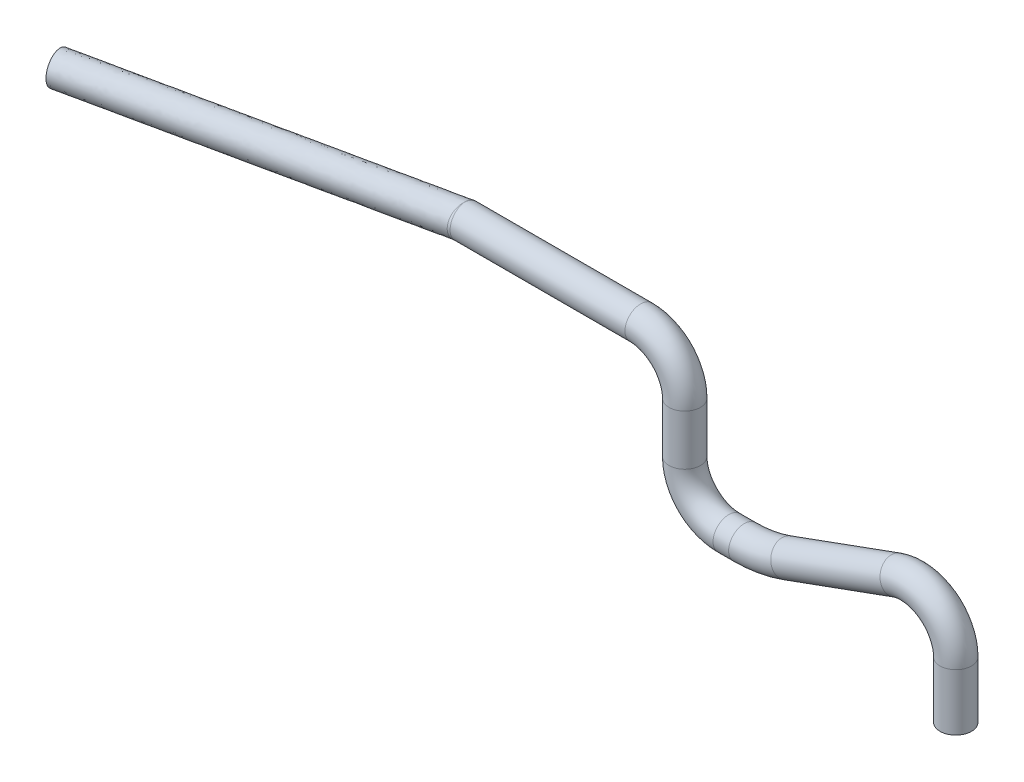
ISO-10303-21;
HEADER;
FILE_DESCRIPTION(('STEP AP214'),'2;1');
FILE_NAME('part.step','',(''),(''),'','','');
FILE_SCHEMA(('AUTOMOTIVE_DESIGN { 1 0 10303 214 1 1 1 1 }'));
ENDSEC;
DATA;
#1=APPLICATION_CONTEXT('core data for automotive mechanical design processes');
#2=APPLICATION_PROTOCOL_DEFINITION('international standard','automotive_design',2000,#1);
#3=PRODUCT_CONTEXT('',#1,'mechanical');
#4=PRODUCT('Part','Part','',(#3));
#5=PRODUCT_RELATED_PRODUCT_CATEGORY('part','',(#4));
#6=PRODUCT_DEFINITION_FORMATION('','',#4);
#7=PRODUCT_DEFINITION_CONTEXT('part definition',#1,'design');
#8=PRODUCT_DEFINITION('design','',#6,#7);
#9=PRODUCT_DEFINITION_SHAPE('','',#8);
#10=(LENGTH_UNIT() NAMED_UNIT(*) SI_UNIT(.MILLI.,.METRE.));
#11=(NAMED_UNIT(*) PLANE_ANGLE_UNIT() SI_UNIT($,.RADIAN.));
#12=(NAMED_UNIT(*) SI_UNIT($,.STERADIAN.) SOLID_ANGLE_UNIT());
#13=UNCERTAINTY_MEASURE_WITH_UNIT(LENGTH_MEASURE(1.E-05),#10,'distance_accuracy_value','');
#14=(GEOMETRIC_REPRESENTATION_CONTEXT(3) GLOBAL_UNCERTAINTY_ASSIGNED_CONTEXT((#13)) GLOBAL_UNIT_ASSIGNED_CONTEXT((#10,
#11,#12)) REPRESENTATION_CONTEXT('',''));
#15=CARTESIAN_POINT('',(0.,0.,0.));
#16=DIRECTION('',(0.,0.,1.));
#17=DIRECTION('',(1.,0.,0.));
#18=AXIS2_PLACEMENT_3D('',#15,#16,#17);
#19=CARTESIAN_POINT('',(43.0701638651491,-21.0523914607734,0.));
#20=DIRECTION('',(0.,-1.,0.));
#21=DIRECTION('',(1.,0.,0.));
#22=AXIS2_PLACEMENT_3D('',#19,#20,#21);
#23=CYLINDRICAL_SURFACE('',#22,2.5);
#24=CARTESIAN_POINT('',(43.0701638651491,-21.0523914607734,0.));
#25=DIRECTION('',(0.,-1.,0.));
#26=DIRECTION('',(0.,0.,-1.));
#27=AXIS2_PLACEMENT_3D('',#24,#25,#26);
#28=CIRCLE('',#27,2.5);
#29=CARTESIAN_POINT('',(45.5701638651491,-21.0523914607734,0.));
#30=VERTEX_POINT('',#29);
#31=EDGE_CURVE('E143',#30,#30,#28,.T.);
#32=ORIENTED_EDGE('',*,*,#31,.T.);
#33=EDGE_LOOP('',(#32));
#34=FACE_BOUND('',#33,.T.);
#35=CARTESIAN_POINT('',(43.0701638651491,-30.0553554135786,0.));
#36=DIRECTION('',(0.,-1.,0.));
#37=DIRECTION('',(0.,0.,-1.));
#38=AXIS2_PLACEMENT_3D('',#35,#36,#37);
#39=CIRCLE('',#38,2.5);
#40=CARTESIAN_POINT('',(43.0701638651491,-30.0553554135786,-2.5));
#41=VERTEX_POINT('',#40);
#42=EDGE_CURVE('E59',#41,#41,#39,.T.);
#43=ORIENTED_EDGE('',*,*,#42,.F.);
#44=EDGE_LOOP('',(#43));
#45=FACE_BOUND('',#44,.T.);
#46=ADVANCED_FACE('F28',(#34,#45),#23,.T.);
#47=CARTESIAN_POINT('',(36.0701638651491,-21.0523914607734,0.));
#48=DIRECTION('',(0.,0.,-1.));
#49=DIRECTION('',(-1.,0.,0.));
#50=AXIS2_PLACEMENT_3D('',#47,#48,#49);
#51=TOROIDAL_SURFACE('',#50,7.,2.5);
#52=CARTESIAN_POINT('',(33.6760228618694,-14.474543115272,0.));
#53=DIRECTION('',(0.939692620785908,0.34202014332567,0.));
#54=DIRECTION('',(0.,0.,-1.));
#55=AXIS2_PLACEMENT_3D('',#52,#53,#54);
#56=CIRCLE('',#55,2.5);
#57=CARTESIAN_POINT('',(32.8209725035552,-12.1253115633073,0.));
#58=VERTEX_POINT('',#57);
#59=EDGE_CURVE('E140',#58,#58,#56,.T.);
#60=CARTESIAN_POINT('',(36.0701638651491,-21.0523914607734,0.));
#61=DIRECTION('',(0.,0.,-1.));
#62=DIRECTION('',(-1.,0.,0.));
#63=AXIS2_PLACEMENT_3D('',#60,#61,#62);
#64=CIRCLE('',#63,9.5);
#65=EDGE_CURVE('',#58,#30,#64,.T.);
#66=ORIENTED_EDGE('',*,*,#59,.T.);
#67=ORIENTED_EDGE('',*,*,#31,.F.);
#68=ORIENTED_EDGE('',*,*,#65,.T.);
#69=ORIENTED_EDGE('',*,*,#65,.F.);
#70=EDGE_LOOP('',(#66,#68,#67,#69));
#71=FACE_BOUND('',#70,.T.);
#72=ADVANCED_FACE('F150',(#71),#51,.T.);
#73=CARTESIAN_POINT('',(16.3138632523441,-20.7938524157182,0.));
#74=DIRECTION('',(0.939692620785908,0.34202014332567,0.));
#75=DIRECTION('',(-0.34202014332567,0.939692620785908,0.));
#76=AXIS2_PLACEMENT_3D('',#73,#74,#75);
#77=CYLINDRICAL_SURFACE('',#76,2.5);
#78=CARTESIAN_POINT('',(16.3138632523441,-20.7938524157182,0.));
#79=DIRECTION('',(0.939692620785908,0.34202014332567,0.));
#80=DIRECTION('',(0.,0.,-1.));
#81=AXIS2_PLACEMENT_3D('',#78,#79,#80);
#82=CIRCLE('',#81,2.5);
#83=CARTESIAN_POINT('',(17.1689136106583,-23.1430839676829,0.));
#84=VERTEX_POINT('',#83);
#85=EDGE_CURVE('E137',#84,#84,#82,.T.);
#86=ORIENTED_EDGE('',*,*,#85,.T.);
#87=EDGE_LOOP('',(#86));
#88=FACE_BOUND('',#87,.T.);
#89=ORIENTED_EDGE('',*,*,#59,.F.);
#90=EDGE_LOOP('',(#89));
#91=FACE_BOUND('',#90,.T.);
#92=ADVANCED_FACE('F156',(#88,#91),#77,.T.);
#93=CARTESIAN_POINT('',(9.47346038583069,-2.,0.));
#94=DIRECTION('',(0.,0.,1.));
#95=DIRECTION('',(1.,0.,0.));
#96=AXIS2_PLACEMENT_3D('',#93,#94,#95);
#97=TOROIDAL_SURFACE('',#96,20.,2.5);
#98=CARTESIAN_POINT('',(9.47346038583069,-22.,0.));
#99=DIRECTION('',(1.,0.,0.));
#100=DIRECTION('',(0.,0.,-1.));
#101=AXIS2_PLACEMENT_3D('',#98,#99,#100);
#102=CIRCLE('',#101,2.5);
#103=CARTESIAN_POINT('',(9.47346038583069,-24.5,0.));
#104=VERTEX_POINT('',#103);
#105=EDGE_CURVE('E134',#104,#104,#102,.T.);
#106=CARTESIAN_POINT('',(9.47346038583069,-2.,0.));
#107=DIRECTION('',(0.,0.,1.));
#108=DIRECTION('',(1.,0.,0.));
#109=AXIS2_PLACEMENT_3D('',#106,#107,#108);
#110=CIRCLE('',#109,22.5);
#111=EDGE_CURVE('',#104,#84,#110,.T.);
#112=ORIENTED_EDGE('',*,*,#105,.T.);
#113=ORIENTED_EDGE('',*,*,#85,.F.);
#114=ORIENTED_EDGE('',*,*,#111,.T.);
#115=ORIENTED_EDGE('',*,*,#111,.F.);
#116=EDGE_LOOP('',(#112,#114,#113,#115));
#117=FACE_BOUND('',#116,.T.);
#118=ADVANCED_FACE('F163',(#117),#97,.T.);
#119=CARTESIAN_POINT('',(7.00000000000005,-22.,0.));
#120=DIRECTION('',(1.,0.,0.));
#121=DIRECTION('',(0.,1.,0.));
#122=AXIS2_PLACEMENT_3D('',#119,#120,#121);
#123=CYLINDRICAL_SURFACE('',#122,2.5);
#124=CARTESIAN_POINT('',(7.00000000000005,-22.,0.));
#125=DIRECTION('',(1.,0.,0.));
#126=DIRECTION('',(0.,0.,-1.));
#127=AXIS2_PLACEMENT_3D('',#124,#125,#126);
#128=CIRCLE('',#127,2.5);
#129=CARTESIAN_POINT('',(7.00000000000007,-24.5,0.));
#130=VERTEX_POINT('',#129);
#131=EDGE_CURVE('E131',#130,#130,#128,.T.);
#132=ORIENTED_EDGE('',*,*,#131,.T.);
#133=EDGE_LOOP('',(#132));
#134=FACE_BOUND('',#133,.T.);
#135=ORIENTED_EDGE('',*,*,#105,.F.);
#136=EDGE_LOOP('',(#135));
#137=FACE_BOUND('',#136,.T.);
#138=ADVANCED_FACE('F167',(#134,#137),#123,.T.);
#139=CARTESIAN_POINT('',(7.,-15.,0.));
#140=DIRECTION('',(0.,0.,1.));
#141=DIRECTION('',(1.,0.,0.));
#142=AXIS2_PLACEMENT_3D('',#139,#140,#141);
#143=TOROIDAL_SURFACE('',#142,7.,2.5);
#144=CARTESIAN_POINT('',(0.,-14.9999999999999,0.));
#145=DIRECTION('',(0.,-1.,0.));
#146=DIRECTION('',(0.,0.,-1.));
#147=AXIS2_PLACEMENT_3D('',#144,#145,#146);
#148=CIRCLE('',#147,2.5);
#149=CARTESIAN_POINT('',(-2.5,-14.9999999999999,0.));
#150=VERTEX_POINT('',#149);
#151=EDGE_CURVE('E128',#150,#150,#148,.T.);
#152=CARTESIAN_POINT('',(7.,-15.,0.));
#153=DIRECTION('',(0.,0.,1.));
#154=DIRECTION('',(1.,0.,0.));
#155=AXIS2_PLACEMENT_3D('',#152,#153,#154);
#156=CIRCLE('',#155,9.5);
#157=EDGE_CURVE('',#150,#130,#156,.T.);
#158=ORIENTED_EDGE('',*,*,#151,.T.);
#159=ORIENTED_EDGE('',*,*,#131,.F.);
#160=ORIENTED_EDGE('',*,*,#157,.T.);
#161=ORIENTED_EDGE('',*,*,#157,.F.);
#162=EDGE_LOOP('',(#158,#160,#159,#161));
#163=FACE_BOUND('',#162,.T.);
#164=ADVANCED_FACE('F171',(#163),#143,.T.);
#165=CARTESIAN_POINT('',(0.,-7.00000000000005,0.));
#166=DIRECTION('',(0.,-1.,0.));
#167=DIRECTION('',(1.,0.,0.));
#168=AXIS2_PLACEMENT_3D('',#165,#166,#167);
#169=CYLINDRICAL_SURFACE('',#168,2.5);
#170=CARTESIAN_POINT('',(0.,-7.00000000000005,0.));
#171=DIRECTION('',(0.,-1.,0.));
#172=DIRECTION('',(0.,0.,-1.));
#173=AXIS2_PLACEMENT_3D('',#170,#171,#172);
#174=CIRCLE('',#173,2.5);
#175=CARTESIAN_POINT('',(2.5,-7.00000000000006,0.));
#176=VERTEX_POINT('',#175);
#177=EDGE_CURVE('E125',#176,#176,#174,.T.);
#178=ORIENTED_EDGE('',*,*,#177,.T.);
#179=EDGE_LOOP('',(#178));
#180=FACE_BOUND('',#179,.T.);
#181=ORIENTED_EDGE('',*,*,#151,.F.);
#182=EDGE_LOOP('',(#181));
#183=FACE_BOUND('',#182,.T.);
#184=ADVANCED_FACE('F174',(#180,#183),#169,.T.);
#185=CARTESIAN_POINT('',(-7.,-7.,0.));
#186=DIRECTION('',(0.,0.,-1.));
#187=DIRECTION('',(-1.,0.,0.));
#188=AXIS2_PLACEMENT_3D('',#185,#186,#187);
#189=TOROIDAL_SURFACE('',#188,7.,2.5);
#190=CARTESIAN_POINT('',(-7.00000000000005,0.,0.));
#191=DIRECTION('',(1.,0.,0.));
#192=DIRECTION('',(0.,0.,-1.));
#193=AXIS2_PLACEMENT_3D('',#190,#191,#192);
#194=CIRCLE('',#193,2.5);
#195=CARTESIAN_POINT('',(-7.00000000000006,2.5,0.));
#196=VERTEX_POINT('',#195);
#197=EDGE_CURVE('E122',#196,#196,#194,.T.);
#198=CARTESIAN_POINT('',(-7.,-7.,0.));
#199=DIRECTION('',(0.,0.,-1.));
#200=DIRECTION('',(-1.,0.,0.));
#201=AXIS2_PLACEMENT_3D('',#198,#199,#200);
#202=CIRCLE('',#201,9.5);
#203=EDGE_CURVE('',#196,#176,#202,.T.);
#204=ORIENTED_EDGE('',*,*,#197,.T.);
#205=ORIENTED_EDGE('',*,*,#177,.F.);
#206=ORIENTED_EDGE('',*,*,#203,.T.);
#207=ORIENTED_EDGE('',*,*,#203,.F.);
#208=EDGE_LOOP('',(#204,#206,#205,#207));
#209=FACE_BOUND('',#208,.T.);
#210=ADVANCED_FACE('F83',(#209),#189,.T.);
#211=CARTESIAN_POINT('',(-7.00000000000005,0.,0.));
#212=DIRECTION('',(-1.,0.,0.));
#213=DIRECTION('',(0.,0.,1.));
#214=AXIS2_PLACEMENT_3D('',#211,#212,#213);
#215=CYLINDRICAL_SURFACE('',#214,2.5);
#216=ORIENTED_EDGE('',*,*,#197,.F.);
#217=EDGE_LOOP('',(#216));
#218=FACE_BOUND('',#217,.T.);
#219=CARTESIAN_POINT('',(-34.9999999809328,-2.5,8.97040289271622E-08));
#220=CARTESIAN_POINT('',(-34.9999999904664,-2.5,4.48520144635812E-08));
#221=CARTESIAN_POINT('',(-35.,-2.5,0.));
#222=CARTESIAN_POINT('',(-35.0018303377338,-2.5000028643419,-0.0201169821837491));
#223=CARTESIAN_POINT('',(-35.0000868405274,-2.50000143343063,-0.0193385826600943));
#224=CARTESIAN_POINT('',(-34.9983433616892,-2.50000049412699,-0.0185602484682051));
#225=CARTESIAN_POINT('',(-35.0036609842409,-2.49974997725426,-0.0402379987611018));
#226=CARTESIAN_POINT('',(-35.0001736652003,-2.49977711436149,-0.0386814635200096));
#227=CARTESIAN_POINT('',(-34.9966863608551,-2.49979370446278,-0.0371248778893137));
#228=CARTESIAN_POINT('',(-35.0204399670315,-2.49510044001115,-0.224693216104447));
#229=CARTESIAN_POINT('',(-35.0009677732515,-2.49565600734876,-0.216028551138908));
#230=CARTESIAN_POINT('',(-34.9814946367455,-2.49599720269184,-0.207349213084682));
#231=CARTESIAN_POINT('',(-35.035341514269,-2.47399408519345,-0.388756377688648));
#232=CARTESIAN_POINT('',(-35.0016607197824,-2.47695775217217,-0.373957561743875));
#233=CARTESIAN_POINT('',(-34.9679713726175,-2.47878311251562,-0.359023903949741));
#234=CARTESIAN_POINT('',(-35.0639952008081,-2.39945108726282,-0.707953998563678));
#235=CARTESIAN_POINT('',(-35.0028065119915,-2.4100768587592,-0.683674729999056));
#236=CARTESIAN_POINT('',(-34.9414987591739,-2.41663494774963,-0.658267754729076));
#237=CARTESIAN_POINT('',(-35.0777442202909,-2.34592972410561,-0.863063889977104));
#238=CARTESIAN_POINT('',(-35.0032588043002,-2.36179535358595,-0.835490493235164));
#239=CARTESIAN_POINT('',(-34.9285510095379,-2.37162822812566,-0.805825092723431));
#240=CARTESIAN_POINT('',(-35.1032870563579,-2.21076593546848,-1.15673884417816));
#241=CARTESIAN_POINT('',(-35.0038242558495,-2.23766860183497,-1.12660929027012));
#242=CARTESIAN_POINT('',(-34.9038113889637,-2.25444410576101,-1.09139806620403));
#243=CARTESIAN_POINT('',(-35.1150907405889,-2.12927233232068,-1.29538634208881));
#244=CARTESIAN_POINT('',(-35.0039390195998,-2.16194173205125,-1.26599064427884));
#245=CARTESIAN_POINT('',(-34.8920138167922,-2.18241031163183,-1.2294596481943));
#246=CARTESIAN_POINT('',(-35.1364995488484,-1.94288593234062,-1.55243396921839));
#247=CARTESIAN_POINT('',(-35.0038706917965,-1.98540115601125,-1.52812545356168));
#248=CARTESIAN_POINT('',(-34.8699348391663,-2.01224552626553,-1.4917280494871));
#249=CARTESIAN_POINT('',(-35.1461072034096,-1.83802034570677,-1.67085736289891));
#250=CARTESIAN_POINT('',(-35.0036877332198,-1.88459680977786,-1.65088919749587));
#251=CARTESIAN_POINT('',(-34.8596516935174,-1.91414485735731,-1.61595073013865));
#252=CARTESIAN_POINT('',(-35.1624441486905,-1.61832580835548,-1.87656372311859));
#253=CARTESIAN_POINT('',(-35.0031627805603,-1.66964869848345,-1.86700965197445));
#254=CARTESIAN_POINT('',(-34.8416462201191,-1.70244971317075,-1.83664064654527));
#255=CARTESIAN_POINT('',(-35.1693364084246,-1.50485443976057,-1.96552663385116));
#256=CARTESIAN_POINT('',(-35.0028337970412,-1.55708540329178,-1.96187574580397));
#257=CARTESIAN_POINT('',(-34.8337888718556,-1.59059313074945,-1.93449795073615));
#258=CARTESIAN_POINT('',(-35.181274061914,-1.2655798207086,-2.12224313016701));
#259=CARTESIAN_POINT('',(-35.0021349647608,-1.31648127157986,-2.13071949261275));
#260=CARTESIAN_POINT('',(-34.8198697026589,-1.34935210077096,-2.10984649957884));
#261=CARTESIAN_POINT('',(-35.1863193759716,-1.13977603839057,-2.1899958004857));
#262=CARTESIAN_POINT('',(-35.0017651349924,-1.18844616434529,-2.20467486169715));
#263=CARTESIAN_POINT('',(-34.8138079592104,-1.21996689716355,-2.1873368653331));
#264=CARTESIAN_POINT('',(-35.1943059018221,-0.890015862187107,-2.29857146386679));
#265=CARTESIAN_POINT('',(-35.0011148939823,-0.931689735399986,-2.32405515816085));
#266=CARTESIAN_POINT('',(-34.8040583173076,-0.958809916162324,-2.31300463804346));
#267=CARTESIAN_POINT('',(-35.1973838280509,-0.766726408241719,-2.3411236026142));
#268=CARTESIAN_POINT('',(-35.0008297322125,-0.803862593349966,-2.3712844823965));
#269=CARTESIAN_POINT('',(-34.8002185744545,-0.828069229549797,-2.36303996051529));
#270=CARTESIAN_POINT('',(-35.2020962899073,-0.515734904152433,-2.40669572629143));
#271=CARTESIAN_POINT('',(-35.0003724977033,-0.542097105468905,-2.44434127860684));
#272=CARTESIAN_POINT('',(-34.7942910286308,-0.559341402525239,-2.44061407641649));
#273=CARTESIAN_POINT('',(-35.2037343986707,-0.388044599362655,-2.42976405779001));
#274=CARTESIAN_POINT('',(-35.000200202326,-0.408190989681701,-2.47021183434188));
#275=CARTESIAN_POINT('',(-34.792198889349,-0.421373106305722,-2.46820854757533));
#276=CARTESIAN_POINT('',(-35.2049863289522,-0.216479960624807,-2.44741768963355));
#277=CARTESIAN_POINT('',(-35.0000673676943,-0.227846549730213,-2.49002667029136));
#278=CARTESIAN_POINT('',(-34.7905972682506,-0.235284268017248,-2.48935218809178));
#279=CARTESIAN_POINT('',(-35.2052220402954,-0.173250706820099,-2.45074496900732));
#280=CARTESIAN_POINT('',(-35.000042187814,-0.182368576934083,-2.4937636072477));
#281=CARTESIAN_POINT('',(-34.7902953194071,-0.188335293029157,-2.49334112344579));
#282=CARTESIAN_POINT('',(-35.2055363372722,-0.0866876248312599,-2.45518427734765));
#283=CARTESIAN_POINT('',(-35.0000084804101,-0.091267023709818,-2.49875120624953));
#284=CARTESIAN_POINT('',(-34.7898923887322,-0.0942647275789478,-2.49866621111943));
#285=CARTESIAN_POINT('',(-35.2056149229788,-0.0433537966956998,-2.45629630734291));
#286=CARTESIAN_POINT('',(-34.9999999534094,-0.0456441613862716,-2.50000179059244));
#287=CARTESIAN_POINT('',(-34.7897914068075,-0.047143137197,-2.50000236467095));
#288=CARTESIAN_POINT('',(-35.2056148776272,0.122223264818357,-2.45629208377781));
#289=CARTESIAN_POINT('',(-35.0000001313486,0.128680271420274,-2.49999495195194));
#290=CARTESIAN_POINT('',(-34.7897918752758,0.132906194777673,-2.4999933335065));
#291=CARTESIAN_POINT('',(-35.2049901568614,0.244605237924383,-2.4474418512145));
#292=CARTESIAN_POINT('',(-35.0000684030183,0.257518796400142,-2.49003640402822));
#293=CARTESIAN_POINT('',(-34.7905957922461,0.265983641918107,-2.48934823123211));
#294=CARTESIAN_POINT('',(-35.2024771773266,0.487195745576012,-2.41210513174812));
#295=CARTESIAN_POINT('',(-35.0003302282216,0.512145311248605,-2.45043384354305));
#296=CARTESIAN_POINT('',(-34.7937993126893,0.528457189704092,-2.44713472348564));
#297=CARTESIAN_POINT('',(-35.2005863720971,0.607399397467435,-2.38558310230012));
#298=CARTESIAN_POINT('',(-35.0005240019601,0.637911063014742,-2.42075513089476));
#299=CARTESIAN_POINT('',(-34.7962021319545,0.657845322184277,-2.41552415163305));
#300=CARTESIAN_POINT('',(-35.1955104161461,0.842922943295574,-2.31525947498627));
#301=CARTESIAN_POINT('',(-35.0010015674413,0.882885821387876,-2.34259611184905));
#302=CARTESIAN_POINT('',(-34.8025514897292,0.908901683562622,-2.33266538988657));
#303=CARTESIAN_POINT('',(-35.1923276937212,0.958251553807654,-2.27149029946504));
#304=CARTESIAN_POINT('',(-35.0012851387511,1.00209341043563,-2.29416049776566));
#305=CARTESIAN_POINT('',(-34.8064951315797,1.03058390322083,-2.28145405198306));
#306=CARTESIAN_POINT('',(-35.1846210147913,1.1818632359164,-2.16722608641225));
#307=CARTESIAN_POINT('',(-35.0018878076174,1.23128122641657,-2.17983769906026));
#308=CARTESIAN_POINT('',(-34.8158439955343,1.26324311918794,-2.16133308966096));
#309=CARTESIAN_POINT('',(-35.1800975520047,1.29014888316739,-2.10673720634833));
#310=CARTESIAN_POINT('',(-35.0022068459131,1.34125554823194,-2.11396959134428));
#311=CARTESIAN_POINT('',(-34.8212486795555,1.37422403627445,-2.09242998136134));
#312=CARTESIAN_POINT('',(-35.1695242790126,1.49999091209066,-1.96806025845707));
#313=CARTESIAN_POINT('',(-35.0028195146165,1.55213374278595,-1.96464384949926));
#314=CARTESIAN_POINT('',(-34.8335618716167,1.58557735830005,-1.93740700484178));
#315=CARTESIAN_POINT('',(-35.1634391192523,1.60131121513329,-1.88946731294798));
#316=CARTESIAN_POINT('',(-35.0031123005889,1.65273888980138,-1.8808014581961));
#317=CARTESIAN_POINT('',(-34.8405046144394,1.68561496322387,-1.85089959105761));
#318=CARTESIAN_POINT('',(-35.1497611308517,1.79159393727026,-1.71658767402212));
#319=CARTESIAN_POINT('',(-35.0035840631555,1.8393852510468,-1.69874351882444));
#320=CARTESIAN_POINT('',(-34.855657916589,1.8697373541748,-1.66470418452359));
#321=CARTESIAN_POINT('',(-35.1421678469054,1.88055261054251,-1.62229624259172));
#322=CARTESIAN_POINT('',(-35.003763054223,1.92542455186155,-1.60053700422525));
#323=CARTESIAN_POINT('',(-34.8638688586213,1.95381730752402,-1.5650122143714));
#324=CARTESIAN_POINT('',(-35.1249698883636,2.04848461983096,-1.41328845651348));
#325=CARTESIAN_POINT('',(-35.0039428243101,2.08582032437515,-1.38574509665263));
#326=CARTESIAN_POINT('',(-34.8819122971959,2.10928719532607,-1.34896197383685));
#327=CARTESIAN_POINT('',(-35.1152699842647,2.12650255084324,-1.29767056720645));
#328=CARTESIAN_POINT('',(-35.0039320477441,2.15914147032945,-1.26840413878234));
#329=CARTESIAN_POINT('',(-34.8918136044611,2.17957335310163,-1.23195477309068));
#330=CARTESIAN_POINT('',(-35.094321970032,2.26243863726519,-1.05302358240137));
#331=CARTESIAN_POINT('',(-35.0036576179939,2.28539587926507,-1.02335896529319));
#332=CARTESIAN_POINT('',(-34.9125736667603,2.2996781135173,-0.989825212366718));
#333=CARTESIAN_POINT('',(-35.0830733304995,2.32034989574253,-0.923989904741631));
#334=CARTESIAN_POINT('',(-35.0033940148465,2.33833918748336,-0.89564732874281));
#335=CARTESIAN_POINT('',(-34.9234327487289,2.34948969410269,-0.8647000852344));
#336=CARTESIAN_POINT('',(-35.0609159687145,2.40715419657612,-0.673607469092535));
#337=CARTESIAN_POINT('',(-35.002685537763,2.41704416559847,-0.650310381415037));
#338=CARTESIAN_POINT('',(-34.9443489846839,2.42314711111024,-0.626014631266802));
#339=CARTESIAN_POINT('',(-35.0501509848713,2.43882907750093,-0.553418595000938));
#340=CARTESIAN_POINT('',(-35.0022685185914,2.44544374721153,-0.533504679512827));
#341=CARTESIAN_POINT('',(-34.9543285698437,2.44951565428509,-0.513047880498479));
#342=CARTESIAN_POINT('',(-35.028096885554,2.48329185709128,-0.308997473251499));
#343=CARTESIAN_POINT('',(-35.0013236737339,2.48517840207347,-0.297180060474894));
#344=CARTESIAN_POINT('',(-34.9745455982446,2.4863381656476,-0.285292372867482));
#345=CARTESIAN_POINT('',(-35.0168087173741,2.49611261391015,-0.184772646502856));
#346=CARTESIAN_POINT('',(-35.0007959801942,2.49655085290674,-0.177644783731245));
#347=CARTESIAN_POINT('',(-34.9847825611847,2.4968198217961,-0.170507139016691));
#348=CARTESIAN_POINT('',(-35.0036610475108,2.49974899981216,-0.0402389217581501));
#349=CARTESIAN_POINT('',(-35.0001736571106,2.49977662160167,-0.038682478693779));
#350=CARTESIAN_POINT('',(-34.996686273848,2.4997935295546,-0.0371259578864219));
#351=CARTESIAN_POINT('',(-35.0018304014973,2.50000179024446,-0.0201179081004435));
#352=CARTESIAN_POINT('',(-35.0000868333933,2.50000090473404,-0.0193396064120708));
#353=CARTESIAN_POINT('',(-34.9983432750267,2.50000032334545,-0.0185613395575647));
#354=CARTESIAN_POINT('',(-34.9999999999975,2.5,1.16781584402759E-11));
#355=CARTESIAN_POINT('',(-34.9999999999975,2.5,1.16781584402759E-11));
#356=CARTESIAN_POINT('',(-35.,2.5,0.));
#357=(BOUNDED_SURFACE() B_SPLINE_SURFACE(3,2,((#219,#220,#221),(#222,#223,#224),(#225,#226,
#227),(#228,#229,#230),(#231,#232,#233),(#234,#235,#236),(#237,#238,#239),(#240,#241,#242),
(#243,#244,#245),(#246,#247,#248),(#249,#250,#251),(#252,#253,#254),(#255,#256,#257),(#258,#259,
#260),(#261,#262,#263),(#264,#265,#266),(#267,#268,#269),(#270,#271,#272),(#273,#274,#275),
(#276,#277,#278),(#279,#280,#281),(#282,#283,#284),(#285,#286,#287),(#288,#289,#290),(#291,#292,
#293),(#294,#295,#296),(#297,#298,#299),(#300,#301,#302),(#303,#304,#305),(#306,#307,#308),
(#309,#310,#311),(#312,#313,#314),(#315,#316,#317),(#318,#319,#320),(#321,#322,#323),(#324,#325,
#326),(#327,#328,#329),(#330,#331,#332),(#333,#334,#335),(#336,#337,#338),(#339,#340,#341),
(#342,#343,#344),(#345,#346,#347),(#348,#349,#350),(#351,#352,#353),(#354,#355,#356)),
.UNSPECIFIED.,.F.,.F.,.F.) B_SPLINE_SURFACE_WITH_KNOTS((4,2,2,2,2,2,2,2,2,2,2,2,2,2,2,2,2,2,2,2,
2,2,4),(3,3),(0.,0.0121973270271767,0.1118393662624,0.211742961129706,0.311123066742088,
0.410388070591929,0.502129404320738,0.593874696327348,0.678232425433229,0.76238021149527,
0.790653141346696,0.818926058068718,0.898633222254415,0.978501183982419,1.05821971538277,
1.13790892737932,1.21959147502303,1.3012987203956,1.38804985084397,1.47483070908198,
1.55040332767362,1.62584408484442,1.63804141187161),(0.,1.),
.UNSPECIFIED.) GEOMETRIC_REPRESENTATION_ITEM() RATIONAL_B_SPLINE_SURFACE(((1.,1.,1.),(1.,
1.00000004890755,1.),(1.,0.99999867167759,1.),(1.,0.999973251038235,1.),(1.,0.999857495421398,
1.),(1.,0.999473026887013,1.),(1.,0.999203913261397,1.),(1.,0.998585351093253,1.),(1.,
0.998236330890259,1.),(1.,0.997528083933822,1.),(1.,0.997168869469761,1.),(1.,0.99651762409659,
1.),(1.,0.996222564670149,1.),(1.,0.995692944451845,1.),(1.,0.995458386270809,1.),(1.,
0.995079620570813,1.),(1.,0.994929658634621,1.),(1.,0.994697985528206,1.),(1.,0.994616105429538,
1.),(1.,0.994553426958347,1.),(1.,0.994541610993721,1.),(1.,0.994525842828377,1.),(1.,
0.994521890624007,1.),(1.,0.994521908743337,1.),(1.,0.994553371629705,1.),(1.,0.994678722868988,
1.),(1.,0.994772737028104,1.),(1.,0.995020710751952,1.),(1.,0.995174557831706,1.),(1.,
0.995537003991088,1.),(1.,0.995745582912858,1.),(1.,0.996213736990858,1.),(1.,0.996474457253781,
1.),(1.,0.997025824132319,1.),(1.,0.9973164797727,1.),(1.,0.997918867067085,1.),(1.,
0.998230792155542,1.),(1.,0.998814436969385,1.),(1.,0.999086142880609,1.),(1.,0.999511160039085,
1.),(1.,0.999675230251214,1.),(1.,0.999908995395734,1.),(1.,0.999978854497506,1.),(1.,
0.999998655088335,1.),(1.,1.00000003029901,1.),(1.,1.,1.))) REPRESENTATION_ITEM('') SURFACE());
#358=CARTESIAN_POINT('',(-35.,-2.5,0.));
#359=CARTESIAN_POINT('',(-34.9983433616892,-2.50000049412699,-0.0185602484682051));
#360=CARTESIAN_POINT('',(-34.9966863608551,-2.49979370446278,-0.0371248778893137));
#361=CARTESIAN_POINT('',(-34.9814946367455,-2.49599720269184,-0.207349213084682));
#362=CARTESIAN_POINT('',(-34.9679713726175,-2.47878311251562,-0.359023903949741));
#363=CARTESIAN_POINT('',(-34.9414987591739,-2.41663494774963,-0.658267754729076));
#364=CARTESIAN_POINT('',(-34.9285510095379,-2.37162822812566,-0.805825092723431));
#365=CARTESIAN_POINT('',(-34.9038113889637,-2.25444410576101,-1.09139806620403));
#366=CARTESIAN_POINT('',(-34.8920138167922,-2.18241031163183,-1.2294596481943));
#367=CARTESIAN_POINT('',(-34.8699348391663,-2.01224552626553,-1.4917280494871));
#368=CARTESIAN_POINT('',(-34.8596516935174,-1.91414485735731,-1.61595073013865));
#369=CARTESIAN_POINT('',(-34.8416462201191,-1.70244971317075,-1.83664064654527));
#370=CARTESIAN_POINT('',(-34.8337888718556,-1.59059313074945,-1.93449795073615));
#371=CARTESIAN_POINT('',(-34.8198697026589,-1.34935210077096,-2.10984649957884));
#372=CARTESIAN_POINT('',(-34.8138079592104,-1.21996689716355,-2.1873368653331));
#373=CARTESIAN_POINT('',(-34.8040583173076,-0.958809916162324,-2.31300463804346));
#374=CARTESIAN_POINT('',(-34.8002185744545,-0.828069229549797,-2.36303996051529));
#375=CARTESIAN_POINT('',(-34.7942910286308,-0.559341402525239,-2.44061407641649));
#376=CARTESIAN_POINT('',(-34.792198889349,-0.421373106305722,-2.46820854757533));
#377=CARTESIAN_POINT('',(-34.7905972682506,-0.235284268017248,-2.48935218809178));
#378=CARTESIAN_POINT('',(-34.7902953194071,-0.188335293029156,-2.49334112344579));
#379=CARTESIAN_POINT('',(-34.7898923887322,-0.0942647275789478,-2.49866621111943));
#380=CARTESIAN_POINT('',(-34.7897914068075,-0.0471431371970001,-2.50000236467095));
#381=CARTESIAN_POINT('',(-34.7897918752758,0.132906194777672,-2.4999933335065));
#382=CARTESIAN_POINT('',(-34.7905957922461,0.265983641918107,-2.48934823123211));
#383=CARTESIAN_POINT('',(-34.7937993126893,0.528457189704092,-2.44713472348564));
#384=CARTESIAN_POINT('',(-34.7962021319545,0.657845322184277,-2.41552415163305));
#385=CARTESIAN_POINT('',(-34.8025514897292,0.908901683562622,-2.33266538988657));
#386=CARTESIAN_POINT('',(-34.8064951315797,1.03058390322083,-2.28145405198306));
#387=CARTESIAN_POINT('',(-34.8158439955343,1.26324311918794,-2.16133308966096));
#388=CARTESIAN_POINT('',(-34.8212486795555,1.37422403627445,-2.09242998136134));
#389=CARTESIAN_POINT('',(-34.8335618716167,1.58557735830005,-1.93740700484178));
#390=CARTESIAN_POINT('',(-34.8405046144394,1.68561496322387,-1.85089959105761));
#391=CARTESIAN_POINT('',(-34.855657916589,1.8697373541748,-1.66470418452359));
#392=CARTESIAN_POINT('',(-34.8638688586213,1.95381730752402,-1.5650122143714));
#393=CARTESIAN_POINT('',(-34.8819122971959,2.10928719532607,-1.34896197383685));
#394=CARTESIAN_POINT('',(-34.8918136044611,2.17957335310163,-1.23195477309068));
#395=CARTESIAN_POINT('',(-34.9125736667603,2.2996781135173,-0.989825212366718));
#396=CARTESIAN_POINT('',(-34.9234327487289,2.34948969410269,-0.8647000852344));
#397=CARTESIAN_POINT('',(-34.9443489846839,2.42314711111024,-0.626014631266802));
#398=CARTESIAN_POINT('',(-34.9543285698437,2.44951565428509,-0.513047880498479));
#399=CARTESIAN_POINT('',(-34.9745455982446,2.4863381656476,-0.285292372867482));
#400=CARTESIAN_POINT('',(-34.9847825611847,2.4968198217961,-0.170507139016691));
#401=CARTESIAN_POINT('',(-34.996686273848,2.4997935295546,-0.0371259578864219));
#402=CARTESIAN_POINT('',(-34.9983432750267,2.50000032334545,-0.0185613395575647));
#403=CARTESIAN_POINT('',(-35.,2.5,0.));
#404=B_SPLINE_CURVE_WITH_KNOTS('',3,(#358,#359,#360,#361,#362,#363,#364,#365,#366,#367,#368,
#369,#370,#371,#372,#373,#374,#375,#376,#377,#378,#379,#380,#381,#382,#383,#384,#385,#386,#387,
#388,#389,#390,#391,#392,#393,#394,#395,#396,#397,#398,#399,#400,#401,#402,#403),.UNSPECIFIED.,
.F.,.F.,(4,2,2,2,2,2,2,2,2,2,2,2,2,2,2,2,2,2,2,2,2,2,4),(0.,0.0121973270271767,0.1118393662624,
0.211742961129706,0.311123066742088,0.410388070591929,0.502129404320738,0.593874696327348,
0.678232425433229,0.76238021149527,0.790653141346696,0.818926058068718,0.898633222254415,
0.978501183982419,1.05821971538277,1.13790892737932,1.21959147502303,1.3012987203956,
1.38804985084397,1.47483070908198,1.55040332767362,1.62584408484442,1.63804141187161),.UNSPECIFIED.);
#405=CARTESIAN_POINT('',(-35.,-2.5,0.));
#406=VERTEX_POINT('',#405);
#407=CARTESIAN_POINT('',(-35.,2.5,0.));
#408=VERTEX_POINT('',#407);
#409=EDGE_CURVE('E52',#406,#408,#404,.T.);
#410=ORIENTED_EDGE('',*,*,#409,.T.);
#411=CARTESIAN_POINT('',(-34.9999999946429,-2.5,2.52030965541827E-08));
#412=CARTESIAN_POINT('',(-34.9999999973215,-2.5,1.26015482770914E-08));
#413=CARTESIAN_POINT('',(-35.,-2.5,0.));
#414=CARTESIAN_POINT('',(-35.00046653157,-2.50000011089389,0.00561377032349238));
#415=CARTESIAN_POINT('',(-34.9999976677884,-2.50000013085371,0.00559173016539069));
#416=CARTESIAN_POINT('',(-34.999528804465,-2.50000012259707,0.00556968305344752));
#417=CARTESIAN_POINT('',(-35.0009331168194,-2.49998185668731,0.0112281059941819));
#418=CARTESIAN_POINT('',(-34.999995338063,-2.49998136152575,0.0111840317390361));
#419=CARTESIAN_POINT('',(-34.9990575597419,-2.49998150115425,0.0111399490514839));
#420=CARTESIAN_POINT('',(-35.0131544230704,-2.49902307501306,0.158285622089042));
#421=CARTESIAN_POINT('',(-34.9999343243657,-2.4989951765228,0.157664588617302));
#422=CARTESIAN_POINT('',(-34.9867141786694,-2.49900323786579,0.157042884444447));
#423=CARTESIAN_POINT('',(-35.0249305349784,-2.48645427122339,0.300004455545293));
#424=CARTESIAN_POINT('',(-34.9998757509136,-2.48606219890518,0.298832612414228));
#425=CARTESIAN_POINT('',(-34.9748197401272,-2.48617671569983,0.297642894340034));
#426=CARTESIAN_POINT('',(-35.0422968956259,-2.45038553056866,0.509500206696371));
#427=CARTESIAN_POINT('',(-34.9997970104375,-2.44902957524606,0.507237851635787));
#428=CARTESIAN_POINT('',(-34.9572605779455,-2.44941857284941,0.505313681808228));
#429=CARTESIAN_POINT('',(-35.0480453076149,-2.43545433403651,0.578930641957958));
#430=CARTESIAN_POINT('',(-34.9997722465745,-2.43370373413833,0.576270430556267));
#431=CARTESIAN_POINT('',(-34.9514452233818,-2.43420638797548,0.574110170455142));
#432=CARTESIAN_POINT('',(-35.0594075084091,-2.39991127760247,0.716402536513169));
#433=CARTESIAN_POINT('',(-34.9997268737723,-2.39726163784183,0.712836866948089));
#434=CARTESIAN_POINT('',(-34.9399420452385,-2.39802171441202,0.710246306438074));
#435=CARTESIAN_POINT('',(-35.0650211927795,-2.37929515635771,0.784442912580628));
#436=CARTESIAN_POINT('',(-34.9997062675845,-2.3761393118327,0.7803724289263));
#437=CARTESIAN_POINT('',(-34.934254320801,-2.37704490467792,0.777584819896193));
#438=CARTESIAN_POINT('',(-35.0815635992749,-2.30918164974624,0.985395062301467));
#439=CARTESIAN_POINT('',(-34.9996523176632,-2.30439055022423,0.979630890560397));
#440=CARTESIAN_POINT('',(-34.9174772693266,-2.30576882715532,0.976311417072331));
#441=CARTESIAN_POINT('',(-35.0922250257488,-2.2513538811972,1.11551544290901));
#442=CARTESIAN_POINT('',(-34.9996267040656,-2.245316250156,1.10835596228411));
#443=CARTESIAN_POINT('',(-34.906642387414,-2.24705718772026,1.10478506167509));
#444=CARTESIAN_POINT('',(-35.1124993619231,-2.11486364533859,1.36442049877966));
#445=CARTESIAN_POINT('',(-34.9995996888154,-2.10640354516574,1.35387996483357));
#446=CARTESIAN_POINT('',(-34.8859848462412,-2.10883441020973,1.35004861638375));
#447=CARTESIAN_POINT('',(-35.1221122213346,-2.03620017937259,1.48320463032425));
#448=CARTESIAN_POINT('',(-34.9995982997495,-2.02654558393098,1.47068524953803));
#449=CARTESIAN_POINT('',(-34.8761622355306,-2.02932227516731,1.46683796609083));
#450=CARTESIAN_POINT('',(-35.1355390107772,-1.90421049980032,1.6502067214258));
#451=CARTESIAN_POINT('',(-34.9996122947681,-1.89310419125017,1.6343672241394));
#452=CARTESIAN_POINT('',(-34.8624026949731,-1.89627812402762,1.63067336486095));
#453=CARTESIAN_POINT('',(-35.1398503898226,-1.85786475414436,1.70402689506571));
#454=CARTESIAN_POINT('',(-34.9996196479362,-1.84631830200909,1.6870331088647));
#455=CARTESIAN_POINT('',(-34.8579773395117,-1.84961724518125,1.68340851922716));
#456=CARTESIAN_POINT('',(-35.1481142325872,-1.76084341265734,1.80753710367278));
#457=CARTESIAN_POINT('',(-34.9996388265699,-1.74855581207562,1.78816127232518));
#458=CARTESIAN_POINT('',(-34.8494822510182,-1.75206392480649,1.78471673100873));
#459=CARTESIAN_POINT('',(-35.1520670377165,-1.71017202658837,1.85723106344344));
#460=CARTESIAN_POINT('',(-34.9996506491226,-1.69758190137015,1.83662634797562));
#461=CARTESIAN_POINT('',(-34.8454121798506,-1.70117559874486,1.83329374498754));
#462=CARTESIAN_POINT('',(-35.1633597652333,-1.55200941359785,1.99968199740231));
#463=CARTESIAN_POINT('',(-34.9996913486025,-1.53874344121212,1.97535517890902));
#464=CARTESIAN_POINT('',(-34.8337668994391,-1.54254311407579,1.9723858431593));
#465=CARTESIAN_POINT('',(-35.1701343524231,-1.43836625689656,2.08581242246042));
#466=CARTESIAN_POINT('',(-34.9997254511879,-1.42500236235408,2.05890425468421));
#467=CARTESIAN_POINT('',(-34.8267562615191,-1.42882794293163,2.05626629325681));
#468=CARTESIAN_POINT('',(-35.1819919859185,-1.19816071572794,2.23741350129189));
#469=CARTESIAN_POINT('',(-34.9997971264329,-1.18539098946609,2.2055912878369));
#470=CARTESIAN_POINT('',(-34.8144546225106,-1.18904354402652,2.20363380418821));
#471=CARTESIAN_POINT('',(-35.1870761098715,-1.07160662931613,2.302897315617));
#472=CARTESIAN_POINT('',(-34.999834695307,-1.05953339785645,2.26872396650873));
#473=CARTESIAN_POINT('',(-34.8091625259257,-1.06298225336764,2.26713385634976));
#474=CARTESIAN_POINT('',(-35.1954506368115,-0.809182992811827,2.41118909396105));
#475=CARTESIAN_POINT('',(-34.9999025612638,-0.799200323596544,2.37295184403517));
#476=CARTESIAN_POINT('',(-34.800429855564,-0.802052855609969,2.37200875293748));
#477=CARTESIAN_POINT('',(-35.1987431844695,-0.673324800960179,2.45402416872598));
#478=CARTESIAN_POINT('',(-34.9999328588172,-0.664751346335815,2.41405619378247));
#479=CARTESIAN_POINT('',(-34.7969870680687,-0.667195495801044,2.41341005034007));
#480=CARTESIAN_POINT('',(-35.2026076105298,-0.447148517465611,2.50439619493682));
#481=CARTESIAN_POINT('',(-34.9999697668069,-0.441242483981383,2.46235619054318));
#482=CARTESIAN_POINT('',(-34.7929427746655,-0.442922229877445,2.462065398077));
#483=CARTESIAN_POINT('',(-35.2037342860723,-0.358377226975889,2.51911537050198));
#484=CARTESIAN_POINT('',(-34.9999809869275,-0.353597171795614,2.47645486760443));
#485=CARTESIAN_POINT('',(-34.791762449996,-0.354954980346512,2.47627248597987));
#486=CARTESIAN_POINT('',(-35.2052380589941,-0.179750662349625,2.53877187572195));
#487=CARTESIAN_POINT('',(-34.9999961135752,-0.177311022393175,2.49527930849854));
#488=CARTESIAN_POINT('',(-34.7901866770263,-0.178005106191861,2.49524172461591));
#489=CARTESIAN_POINT('',(-35.2056151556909,-0.0898953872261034,2.5437091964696));
#490=CARTESIAN_POINT('',(-35.0000000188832,-0.0886772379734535,2.50000353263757));
#491=CARTESIAN_POINT('',(-34.7897912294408,-0.0890224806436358,2.50000386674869));
#492=CARTESIAN_POINT('',(-35.205614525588,0.141692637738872,2.54369786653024));
#493=CARTESIAN_POINT('',(-34.9999999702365,0.139772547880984,2.49999443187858));
#494=CARTESIAN_POINT('',(-34.7897920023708,0.140316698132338,2.49999390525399));
#495=CARTESIAN_POINT('',(-35.2046766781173,0.283484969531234,2.53141379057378));
#496=CARTESIAN_POINT('',(-34.9999901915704,0.279629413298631,2.48824365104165));
#497=CARTESIAN_POINT('',(-34.7907756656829,0.280732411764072,2.48814719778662));
#498=CARTESIAN_POINT('',(-35.2009398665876,0.56293223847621,2.48263971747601));
#499=CARTESIAN_POINT('',(-34.9999535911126,0.555604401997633,2.44150226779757));
#500=CARTESIAN_POINT('',(-34.7946887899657,0.557692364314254,2.44105598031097));
#501=CARTESIAN_POINT('',(-35.1981387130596,0.700582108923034,2.44612124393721));
#502=CARTESIAN_POINT('',(-34.9999267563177,0.691691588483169,2.40649362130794));
#503=CARTESIAN_POINT('',(-34.7976205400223,0.694231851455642,2.40578394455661));
#504=CARTESIAN_POINT('',(-35.1907304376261,0.967489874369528,2.35008356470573));
#505=CARTESIAN_POINT('',(-34.9998633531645,0.956153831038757,2.31416759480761));
#506=CARTESIAN_POINT('',(-34.8053544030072,0.959390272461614,2.31285292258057));
#507=CARTESIAN_POINT('',(-35.1861241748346,1.09675172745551,2.29057530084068));
#508=CARTESIAN_POINT('',(-34.9998267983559,1.08451377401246,2.25687691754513));
#509=CARTESIAN_POINT('',(-34.8101556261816,1.08801294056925,2.255204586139));
#510=CARTESIAN_POINT('',(-35.1752036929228,1.34316782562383,2.15049042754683));
#511=CARTESIAN_POINT('',(-34.9997541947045,1.32992199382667,2.12154381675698));
#512=CARTESIAN_POINT('',(-34.8215019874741,1.33371148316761,2.11918117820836));
#513=CARTESIAN_POINT('',(-35.1688899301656,1.46032529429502,2.06991944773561));
#514=CARTESIAN_POINT('',(-34.9997181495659,1.44696530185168,2.04352536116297));
#515=CARTESIAN_POINT('',(-34.828046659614,1.45079043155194,2.0408116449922));
#516=CARTESIAN_POINT('',(-35.1546944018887,1.67936522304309,1.89017694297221));
#517=CARTESIAN_POINT('',(-34.999657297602,1.66650155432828,1.86881601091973));
#518=CARTESIAN_POINT('',(-34.8427099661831,1.67019012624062,1.8655268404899));
#519=CARTESIAN_POINT('',(-35.1468118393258,1.78123987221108,1.79099596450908));
#520=CARTESIAN_POINT('',(-34.9996324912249,1.76899051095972,1.77213104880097));
#521=CARTESIAN_POINT('',(-34.8508294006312,1.77250332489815,1.76860214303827));
#522=CARTESIAN_POINT('',(-35.1296748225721,1.96693491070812,1.57703067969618));
#523=CARTESIAN_POINT('',(-34.9996027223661,1.95639937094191,1.56277002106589));
#524=CARTESIAN_POINT('',(-34.868420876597,1.95942761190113,1.55896325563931));
#525=CARTESIAN_POINT('',(-35.1204200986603,2.0507517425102,1.46224330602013));
#526=CARTESIAN_POINT('',(-34.999597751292,2.04132861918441,1.45009836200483));
#527=CARTESIAN_POINT('',(-34.8778931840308,2.04403521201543,1.44624596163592));
#528=CARTESIAN_POINT('',(-35.1007786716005,2.19825714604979,1.22028594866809));
#529=CARTESIAN_POINT('',(-34.999611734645,2.19119737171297,1.21181863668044));
#530=CARTESIAN_POINT('',(-34.8979358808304,2.19323149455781,1.20810347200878));
#531=CARTESIAN_POINT('',(-35.0903905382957,2.26191988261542,1.09310034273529));
#532=CARTESIAN_POINT('',(-34.9996307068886,2.25612924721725,1.08619057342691));
#533=CARTESIAN_POINT('',(-34.9085076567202,2.25779448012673,1.0826622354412));
#534=CARTESIAN_POINT('',(-35.0687934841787,2.36738118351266,0.830066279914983));
#535=CARTESIAN_POINT('',(-34.9996909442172,2.36389510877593,0.825725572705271));
#536=CARTESIAN_POINT('',(-34.9304358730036,2.36490219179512,0.822770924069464));
#537=CARTESIAN_POINT('',(-35.0575851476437,2.40919514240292,0.694223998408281));
#538=CARTESIAN_POINT('',(-34.9997321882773,2.40676231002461,0.690879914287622));
#539=CARTESIAN_POINT('',(-34.9417917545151,2.40746242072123,0.688327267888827));
#540=CARTESIAN_POINT('',(-35.0388164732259,2.45908391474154,0.467464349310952));
#541=CARTESIAN_POINT('',(-34.9998120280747,2.45795373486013,0.465447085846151));
#542=CARTESIAN_POINT('',(-34.960781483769,2.45827885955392,0.463661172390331));
#543=CARTESIAN_POINT('',(-35.0313928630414,2.47388358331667,0.377948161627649));
#544=CARTESIAN_POINT('',(-34.9998462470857,2.47315832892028,0.37637050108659));
#545=CARTESIAN_POINT('',(-34.9682861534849,2.47336654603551,0.374912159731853));
#546=CARTESIAN_POINT('',(-35.0164450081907,2.49401540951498,0.197887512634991));
#547=CARTESIAN_POINT('',(-34.9999179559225,2.49384514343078,0.197111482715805));
#548=CARTESIAN_POINT('',(-34.9833904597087,2.49389432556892,0.196331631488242));
#549=CARTESIAN_POINT('',(-35.0089208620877,2.49935623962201,0.107344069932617));
#550=CARTESIAN_POINT('',(-34.9999554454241,2.49933801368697,0.106922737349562));
#551=CARTESIAN_POINT('',(-34.9909900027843,2.49934325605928,0.106501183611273));
#552=CARTESIAN_POINT('',(-35.0009331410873,2.49998179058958,0.011228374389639));
#553=CARTESIAN_POINT('',(-34.9999953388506,2.49998128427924,0.0111843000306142));
#554=CARTESIAN_POINT('',(-34.9990575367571,2.49998142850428,0.0111402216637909));
#555=CARTESIAN_POINT('',(-35.0004665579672,2.50000004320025,0.00561403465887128));
#556=CARTESIAN_POINT('',(-34.9999976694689,2.50000005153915,0.00559199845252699));
#557=CARTESIAN_POINT('',(-34.9995287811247,2.50000004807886,0.00556995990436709));
#558=CARTESIAN_POINT('',(-34.9999999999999,2.5,2.77555756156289E-13));
#559=CARTESIAN_POINT('',(-34.9999999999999,2.5,2.77555756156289E-13));
#560=CARTESIAN_POINT('',(-35.,2.5,0.));
#561=(BOUNDED_SURFACE() B_SPLINE_SURFACE(3,2,((#411,#412,#413),(#414,#415,#416),(#417,#418,
#419),(#420,#421,#422),(#423,#424,#425),(#426,#427,#428),(#429,#430,#431),(#432,#433,#434),
(#435,#436,#437),(#438,#439,#440),(#441,#442,#443),(#444,#445,#446),(#447,#448,#449),(#450,#451,
#452),(#453,#454,#455),(#456,#457,#458),(#459,#460,#461),(#462,#463,#464),(#465,#466,#467),
(#468,#469,#470),(#471,#472,#473),(#474,#475,#476),(#477,#478,#479),(#480,#481,#482),(#483,#484,
#485),(#486,#487,#488),(#489,#490,#491),(#492,#493,#494),(#495,#496,#497),(#498,#499,#500),
(#501,#502,#503),(#504,#505,#506),(#507,#508,#509),(#510,#511,#512),(#513,#514,#515),(#516,#517,
#518),(#519,#520,#521),(#522,#523,#524),(#525,#526,#527),(#528,#529,#530),(#531,#532,#533),
(#534,#535,#536),(#537,#538,#539),(#540,#541,#542),(#543,#544,#545),(#546,#547,#548),(#549,#550,
#551),(#552,#553,#554),(#555,#556,#557),(#558,#559,#560)),.UNSPECIFIED.,.F.,.F.,
.F.) B_SPLINE_SURFACE_WITH_KNOTS((4,2,2,2,2,2,2,2,2,2,2,2,2,2,2,2,2,2,2,2,2,2,2,2,4),(3,3),(0.,
0.0301125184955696,0.788682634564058,1.16922859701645,1.5500605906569,2.30969489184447,
3.06936560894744,3.44944001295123,3.82914865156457,4.58853629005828,5.34743889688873,
6.10543102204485,6.58578083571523,7.06613108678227,7.82325626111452,8.58127266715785,
9.33892874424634,10.0963825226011,10.8542221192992,11.6122108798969,12.3711673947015,
13.1295884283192,13.6154233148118,14.1008125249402,14.1309250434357),(0.,1.),
.UNSPECIFIED.) GEOMETRIC_REPRESENTATION_ITEM() RATIONAL_B_SPLINE_SURFACE(((1.,1.,1.),(1.,
1.00000000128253,1.),(1.,0.999999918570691,1.),(1.,0.999995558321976,1.),(1.,0.999938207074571,
1.),(1.,0.999777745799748,1.),(1.,0.999711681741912,1.),(1.,0.999556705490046,1.),(1.,
0.999467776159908,1.),(1.,0.999170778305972,1.),(1.,0.998932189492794,1.),(1.,0.998401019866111,
1.),(1.,0.998108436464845,1.),(1.,0.997654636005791,1.),(1.,0.997500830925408,1.),(1.,
0.99719270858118,1.),(1.,0.997038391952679,1.),(1.,0.996580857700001,1.),(1.,0.996283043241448,
1.),(1.,0.995736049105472,1.),(1.,0.995486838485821,1.),(1.,0.995064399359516,1.),(1.,
0.994891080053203,1.),(1.,0.994685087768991,1.),(1.,0.994624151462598,1.),(1.,0.99454253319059,
1.),(1.,0.994521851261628,1.),(1.,0.994521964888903,1.),(1.,0.994573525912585,1.),(1.,
0.994774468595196,1.),(1.,0.994923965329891,1.),(1.,0.995304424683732,1.),(1.,0.99553534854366,
1.),(1.,0.996053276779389,1.),(1.,0.996340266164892,1.),(1.,0.996938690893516,1.),(1.,
0.997250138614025,1.),(1.,0.997862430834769,1.),(1.,0.998163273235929,1.),(1.,0.998720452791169,
1.),(1.,0.998976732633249,1.),(1.,0.999414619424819,1.),(1.,0.999596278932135,1.),(1.,
0.999816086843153,1.),(1.,0.999882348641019,1.),(1.,0.999972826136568,1.),(1.,0.999997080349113,
1.),(1.,0.999999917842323,1.),(1.,1.00000000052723,1.),(1.,1.,1.))) REPRESENTATION_ITEM('') SURFACE());
#562=CARTESIAN_POINT('',(-35.,2.5,0.));
#563=CARTESIAN_POINT('',(-34.9995287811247,2.50000004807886,0.00556995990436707));
#564=CARTESIAN_POINT('',(-34.9990575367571,2.49998142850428,0.0111402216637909));
#565=CARTESIAN_POINT('',(-34.9909900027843,2.49934325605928,0.10650118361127));
#566=CARTESIAN_POINT('',(-34.9833904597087,2.49389432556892,0.196331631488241));
#567=CARTESIAN_POINT('',(-34.9682861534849,2.47336654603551,0.374912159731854));
#568=CARTESIAN_POINT('',(-34.960781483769,2.45827885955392,0.463661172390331));
#569=CARTESIAN_POINT('',(-34.9417917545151,2.40746242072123,0.688327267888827));
#570=CARTESIAN_POINT('',(-34.9304358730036,2.36490219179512,0.822770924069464));
#571=CARTESIAN_POINT('',(-34.9085076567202,2.25779448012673,1.0826622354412));
#572=CARTESIAN_POINT('',(-34.8979358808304,2.19323149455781,1.20810347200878));
#573=CARTESIAN_POINT('',(-34.8778931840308,2.04403521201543,1.44624596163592));
#574=CARTESIAN_POINT('',(-34.868420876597,1.95942761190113,1.55896325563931));
#575=CARTESIAN_POINT('',(-34.8508294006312,1.77250332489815,1.76860214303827));
#576=CARTESIAN_POINT('',(-34.8427099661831,1.67019012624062,1.8655268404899));
#577=CARTESIAN_POINT('',(-34.828046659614,1.45079043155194,2.0408116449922));
#578=CARTESIAN_POINT('',(-34.8215019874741,1.33371148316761,2.11918117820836));
#579=CARTESIAN_POINT('',(-34.8101556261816,1.08801294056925,2.255204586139));
#580=CARTESIAN_POINT('',(-34.8053544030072,0.959390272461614,2.31285292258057));
#581=CARTESIAN_POINT('',(-34.7976205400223,0.694231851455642,2.40578394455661));
#582=CARTESIAN_POINT('',(-34.7946887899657,0.557692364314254,2.44105598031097));
#583=CARTESIAN_POINT('',(-34.7907756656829,0.280732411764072,2.48814719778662));
#584=CARTESIAN_POINT('',(-34.7897920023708,0.140316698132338,2.49999390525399));
#585=CARTESIAN_POINT('',(-34.7897912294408,-0.0890224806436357,2.50000386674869));
#586=CARTESIAN_POINT('',(-34.7901866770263,-0.178005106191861,2.49524172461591));
#587=CARTESIAN_POINT('',(-34.791762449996,-0.354954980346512,2.47627248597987));
#588=CARTESIAN_POINT('',(-34.7929427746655,-0.442922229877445,2.462065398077));
#589=CARTESIAN_POINT('',(-34.7969870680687,-0.667195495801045,2.41341005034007));
#590=CARTESIAN_POINT('',(-34.800429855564,-0.802052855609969,2.37200875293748));
#591=CARTESIAN_POINT('',(-34.8091625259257,-1.06298225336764,2.26713385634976));
#592=CARTESIAN_POINT('',(-34.8144546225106,-1.18904354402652,2.20363380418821));
#593=CARTESIAN_POINT('',(-34.8267562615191,-1.42882794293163,2.05626629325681));
#594=CARTESIAN_POINT('',(-34.8337668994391,-1.54254311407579,1.9723858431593));
#595=CARTESIAN_POINT('',(-34.8454121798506,-1.70117559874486,1.83329374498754));
#596=CARTESIAN_POINT('',(-34.8494822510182,-1.75206392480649,1.78471673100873));
#597=CARTESIAN_POINT('',(-34.8579773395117,-1.84961724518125,1.68340851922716));
#598=CARTESIAN_POINT('',(-34.8624026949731,-1.89627812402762,1.63067336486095));
#599=CARTESIAN_POINT('',(-34.8761622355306,-2.02932227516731,1.46683796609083));
#600=CARTESIAN_POINT('',(-34.8859848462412,-2.10883441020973,1.35004861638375));
#601=CARTESIAN_POINT('',(-34.906642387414,-2.24705718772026,1.10478506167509));
#602=CARTESIAN_POINT('',(-34.9174772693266,-2.30576882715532,0.976311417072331));
#603=CARTESIAN_POINT('',(-34.934254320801,-2.37704490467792,0.777584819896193));
#604=CARTESIAN_POINT('',(-34.9399420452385,-2.39802171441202,0.710246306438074));
#605=CARTESIAN_POINT('',(-34.9514452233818,-2.43420638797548,0.574110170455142));
#606=CARTESIAN_POINT('',(-34.9572605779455,-2.44941857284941,0.505313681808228));
#607=CARTESIAN_POINT('',(-34.9748197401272,-2.48617671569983,0.297642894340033));
#608=CARTESIAN_POINT('',(-34.9867141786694,-2.49900323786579,0.157042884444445));
#609=CARTESIAN_POINT('',(-34.9990575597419,-2.49998150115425,0.0111399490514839));
#610=CARTESIAN_POINT('',(-34.999528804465,-2.50000012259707,0.00556968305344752));
#611=CARTESIAN_POINT('',(-35.,-2.5,0.));
#612=B_SPLINE_CURVE_WITH_KNOTS('',3,(#562,#563,#564,#565,#566,#567,#568,#569,#570,#571,#572,
#573,#574,#575,#576,#577,#578,#579,#580,#581,#582,#583,#584,#585,#586,#587,#588,#589,#590,#591,
#592,#593,#594,#595,#596,#597,#598,#599,#600,#601,#602,#603,#604,#605,#606,#607,#608,#609,#610,
#611),.UNSPECIFIED.,.F.,.F.,(4,2,2,2,2,2,2,2,2,2,2,2,2,2,2,2,2,2,2,2,2,2,2,2,4),(0.,
0.0301125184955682,0.51550172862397,1.00133661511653,1.75975764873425,2.51871416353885,
3.27670292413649,4.03454252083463,4.7919962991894,5.54965237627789,6.30766878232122,
7.06479395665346,7.5451442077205,8.02549402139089,8.78348614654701,9.54238875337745,
10.3017763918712,10.6814850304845,11.0615594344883,11.8212301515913,12.5808644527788,
12.9616964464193,13.3422424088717,14.1008125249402,14.1309250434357),.UNSPECIFIED.);
#613=EDGE_CURVE('E56',#408,#406,#612,.T.);
#614=ORIENTED_EDGE('',*,*,#613,.T.);
#615=EDGE_LOOP('',(#410,#614));
#616=FACE_BOUND('',#615,.T.);
#617=ADVANCED_FACE('F58',(#218,#616),#215,.T.);
#618=CARTESIAN_POINT('',(43.0701638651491,-30.0553554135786,0.));
#619=DIRECTION('',(0.,-1.,0.));
#620=DIRECTION('',(0.,0.,-1.));
#621=AXIS2_PLACEMENT_3D('',#618,#619,#620);
#622=PLANE('',#621);
#623=ORIENTED_EDGE('',*,*,#42,.T.);
#624=EDGE_LOOP('',(#623));
#625=FACE_BOUND('',#624,.T.);
#626=ADVANCED_FACE('F82',(#625),#622,.T.);
#627=CARTESIAN_POINT('',(-88.7981180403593,0.,11.4351429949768));
#628=DIRECTION('',(-1.,0.,0.));
#629=DIRECTION('',(0.,0.,1.));
#630=AXIS2_PLACEMENT_3D('',#627,#628,#629);
#631=CIRCLE('',#630,2.5);
#632=DIRECTION('',(0.978147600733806,0.,-0.20791169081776));
#633=VECTOR('',#632,1.);
#634=SURFACE_OF_LINEAR_EXTRUSION('',#631,#633);
#635=CARTESIAN_POINT('',(-88.7981180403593,0.,8.93514299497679));
#636=CARTESIAN_POINT('',(-88.7981179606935,0.0704562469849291,8.93514336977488));
#637=CARTESIAN_POINT('',(-88.7975116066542,0.140920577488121,8.9379960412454));
#638=CARTESIAN_POINT('',(-88.7950912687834,0.281373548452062,8.94938283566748));
#639=CARTESIAN_POINT('',(-88.7932768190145,0.351361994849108,8.95791915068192));
#640=CARTESIAN_POINT('',(-88.7860328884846,0.559842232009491,8.9919991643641));
#641=CARTESIAN_POINT('',(-88.7788028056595,0.696995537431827,9.02601402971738));
#642=CARTESIAN_POINT('',(-88.7597750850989,0.962757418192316,9.1155324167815));
#643=CARTESIAN_POINT('',(-88.7480055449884,1.09141296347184,9.17090374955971));
#644=CARTESIAN_POINT('',(-88.720311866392,1.3364174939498,9.30119226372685));
#645=CARTESIAN_POINT('',(-88.7044271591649,1.45286929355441,9.37592393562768));
#646=CARTESIAN_POINT('',(-88.6690392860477,1.6702861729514,9.54241078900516));
#647=CARTESIAN_POINT('',(-88.6495762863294,1.77140241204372,9.63397700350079));
#648=CARTESIAN_POINT('',(-88.6076491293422,1.955656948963,9.83122876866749));
#649=CARTESIAN_POINT('',(-88.585219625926,2.03897748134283,9.93675128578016));
#650=CARTESIAN_POINT('',(-88.5380220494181,2.18579065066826,10.1587984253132));
#651=CARTESIAN_POINT('',(-88.5132790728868,2.24946975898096,10.2752049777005));
#652=CARTESIAN_POINT('',(-88.4621351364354,2.35574601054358,10.5158182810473));
#653=CARTESIAN_POINT('',(-88.4357485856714,2.39850343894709,10.6399572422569));
#654=CARTESIAN_POINT('',(-88.3819971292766,2.46219356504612,10.89283796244));
#655=CARTESIAN_POINT('',(-88.3546377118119,2.48323322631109,11.021553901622));
#656=CARTESIAN_POINT('',(-88.2996194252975,2.50319759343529,11.2803945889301));
#657=CARTESIAN_POINT('',(-88.2719611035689,2.50215752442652,11.4105167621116));
#658=CARTESIAN_POINT('',(-88.2170490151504,2.47805090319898,11.6688578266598));
#659=CARTESIAN_POINT('',(-88.1897952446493,2.45498455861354,11.7970767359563));
#660=CARTESIAN_POINT('',(-88.1498133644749,2.40447201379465,11.985176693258));
#661=CARTESIAN_POINT('',(-88.1366299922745,2.38496965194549,12.0471995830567));
#662=CARTESIAN_POINT('',(-88.1106417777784,2.34080583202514,12.1694645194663));
#663=CARTESIAN_POINT('',(-88.0978368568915,2.31614545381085,12.2297069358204));
#664=CARTESIAN_POINT('',(-88.0726969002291,2.26185772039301,12.3479811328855));
#665=CARTESIAN_POINT('',(-88.0603616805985,2.2322323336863,12.4060137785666));
#666=CARTESIAN_POINT('',(-88.036227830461,2.16821355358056,12.5195546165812));
#667=CARTESIAN_POINT('',(-88.0244296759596,2.1338160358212,12.5750605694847));
#668=CARTESIAN_POINT('',(-87.9896739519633,2.02290511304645,12.7385733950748));
#669=CARTESIAN_POINT('',(-87.9676660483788,1.93934575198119,12.8421124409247));
#670=CARTESIAN_POINT('',(-87.9267748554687,1.75609411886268,13.0344903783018));
#671=CARTESIAN_POINT('',(-87.9078920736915,1.65639923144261,13.1233268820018));
#672=CARTESIAN_POINT('',(-87.8821187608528,1.49605864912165,13.2445807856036));
#673=CARTESIAN_POINT('',(-87.8738920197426,1.44027169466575,13.2832845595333));
#674=CARTESIAN_POINT('',(-87.8584193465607,1.32569308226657,13.3560777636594));
#675=CARTESIAN_POINT('',(-87.8511725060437,1.26690427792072,13.390171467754));
#676=CARTESIAN_POINT('',(-87.8376949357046,1.14667044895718,13.4535784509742));
#677=CARTESIAN_POINT('',(-87.8314644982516,1.0852246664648,13.4828903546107));
#678=CARTESIAN_POINT('',(-87.8200576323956,0.960110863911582,13.5365554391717));
#679=CARTESIAN_POINT('',(-87.8148814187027,0.896442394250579,13.5609076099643));
#680=CARTESIAN_POINT('',(-87.8009860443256,0.702776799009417,13.6262802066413));
#681=CARTESIAN_POINT('',(-87.7938869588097,0.570001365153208,13.659678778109));
#682=CARTESIAN_POINT('',(-87.7842021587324,0.300693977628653,13.7052421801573));
#683=CARTESIAN_POINT('',(-87.7816163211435,0.164162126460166,13.7174075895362));
#684=CARTESIAN_POINT('',(-87.7811535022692,-0.0404431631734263,13.7195849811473));
#685=CARTESIAN_POINT('',(-87.7815659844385,-0.108530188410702,13.7176444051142));
#686=CARTESIAN_POINT('',(-87.7845065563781,-0.312665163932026,13.7038101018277));
#687=CARTESIAN_POINT('',(-87.7887440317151,-0.448254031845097,13.683874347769));
#688=CARTESIAN_POINT('',(-87.801678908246,-0.71434778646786,13.6230205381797));
#689=CARTESIAN_POINT('',(-87.8103764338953,-0.844852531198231,13.5821018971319));
#690=CARTESIAN_POINT('',(-87.8320334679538,-1.09744721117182,13.4802135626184));
#691=CARTESIAN_POINT('',(-87.8449931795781,-1.21953674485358,13.4192429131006));
#692=CARTESIAN_POINT('',(-87.8748703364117,-1.45196398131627,13.2786819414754));
#693=CARTESIAN_POINT('',(-87.8917880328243,-1.56230093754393,13.1990904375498));
#694=CARTESIAN_POINT('',(-87.9291683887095,-1.76812152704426,13.0232296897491));
#695=CARTESIAN_POINT('',(-87.9496313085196,-1.86360406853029,12.9269592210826));
#696=CARTESIAN_POINT('',(-87.9933661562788,-2.03608695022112,12.7212029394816));
#697=CARTESIAN_POINT('',(-88.0166103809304,-2.11324991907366,12.6118474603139));
#698=CARTESIAN_POINT('',(-88.0652336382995,-2.24730082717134,12.3830930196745));
#699=CARTESIAN_POINT('',(-88.0905908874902,-2.30437005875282,12.2637965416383));
#700=CARTESIAN_POINT('',(-88.1297232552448,-2.37399673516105,12.079693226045));
#701=CARTESIAN_POINT('',(-88.1429087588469,-2.39450475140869,12.0176603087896));
#702=CARTESIAN_POINT('',(-88.1695883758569,-2.43018675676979,11.8921425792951));
#703=CARTESIAN_POINT('',(-88.1830824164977,-2.44536199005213,11.8286581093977));
#704=CARTESIAN_POINT('',(-88.2102283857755,-2.47020106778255,11.7009463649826));
#705=CARTESIAN_POINT('',(-88.2238793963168,-2.47988812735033,11.6367234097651));
#706=CARTESIAN_POINT('',(-88.2513112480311,-2.49378826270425,11.5076666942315));
#707=CARTESIAN_POINT('',(-88.2650921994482,-2.49799617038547,11.4428324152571));
#708=CARTESIAN_POINT('',(-88.3068406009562,-2.50235009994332,11.2464216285));
#709=CARTESIAN_POINT('',(-88.3348668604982,-2.49390838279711,11.1145684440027));
#710=CARTESIAN_POINT('',(-88.3902261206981,-2.45449870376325,10.8541236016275));
#711=CARTESIAN_POINT('',(-88.4175590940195,-2.42352985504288,10.7255320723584));
#712=CARTESIAN_POINT('',(-88.4572765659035,-2.3612720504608,10.5386760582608));
#713=CARTESIAN_POINT('',(-88.4702300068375,-2.33806613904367,10.477734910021));
#714=CARTESIAN_POINT('',(-88.4956859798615,-2.28662040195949,10.3579739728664));
#715=CARTESIAN_POINT('',(-88.5081889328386,-2.2583854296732,10.2991522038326));
#716=CARTESIAN_POINT('',(-88.5326747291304,-2.19706610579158,10.1839555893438));
#717=CARTESIAN_POINT('',(-88.5446574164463,-2.16398031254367,10.1275814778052));
#718=CARTESIAN_POINT('',(-88.5680206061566,-2.09322299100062,10.0176663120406));
#719=CARTESIAN_POINT('',(-88.5794009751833,-2.05555045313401,9.96412588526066));
#720=CARTESIAN_POINT('',(-88.6125258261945,-1.9360302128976,9.80828571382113));
#721=CARTESIAN_POINT('',(-88.6332791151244,-1.84761690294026,9.71064916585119));
#722=CARTESIAN_POINT('',(-88.6619702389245,-1.70401626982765,9.57566804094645));
#723=CARTESIAN_POINT('',(-88.6711307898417,-1.65429624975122,9.5325710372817));
#724=CARTESIAN_POINT('',(-88.6885977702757,-1.5514891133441,9.45039535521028));
#725=CARTESIAN_POINT('',(-88.6969043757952,-1.49840269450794,9.41131584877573));
#726=CARTESIAN_POINT('',(-88.7126090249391,-1.38924389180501,9.33743128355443));
#727=CARTESIAN_POINT('',(-88.7200074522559,-1.3331727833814,9.30262441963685));
#728=CARTESIAN_POINT('',(-88.7338641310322,-1.21835267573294,9.23743387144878));
#729=CARTESIAN_POINT('',(-88.7403215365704,-1.15960132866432,9.20705416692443));
#730=CARTESIAN_POINT('',(-88.7583621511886,-0.978475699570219,9.12217974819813));
#731=CARTESIAN_POINT('',(-88.7684289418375,-0.852515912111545,9.07481922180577));
#732=CARTESIAN_POINT('',(-88.7842908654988,-0.594546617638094,9.00019473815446));
#733=CARTESIAN_POINT('',(-88.7900868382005,-0.4625383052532,8.97292683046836));
#734=CARTESIAN_POINT('',(-88.7951644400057,-0.274681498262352,8.94903859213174));
#735=CARTESIAN_POINT('',(-88.79627189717,-0.219864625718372,8.94382841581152));
#736=CARTESIAN_POINT('',(-88.7977484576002,-0.110033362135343,8.93688174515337));
#737=CARTESIAN_POINT('',(-88.7981181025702,-0.0550191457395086,8.9351427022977));
#738=CARTESIAN_POINT('',(-88.7981180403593,0.,8.93514299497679));
#739=B_SPLINE_CURVE_WITH_KNOTS('',3,(#635,#636,#637,#638,#639,#640,#641,#642,#643,#644,#645,
#646,#647,#648,#649,#650,#651,#652,#653,#654,#655,#656,#657,#658,#659,#660,#661,#662,#663,#664,
#665,#666,#667,#668,#669,#670,#671,#672,#673,#674,#675,#676,#677,#678,#679,#680,#681,#682,#683,
#684,#685,#686,#687,#688,#689,#690,#691,#692,#693,#694,#695,#696,#697,#698,#699,#700,#701,#702,
#703,#704,#705,#706,#707,#708,#709,#710,#711,#712,#713,#714,#715,#716,#717,#718,#719,#720,#721,
#722,#723,#724,#725,#726,#727,#728,#729,#730,#731,#732,#733,#734,#735,#736,#737,#738),
.UNSPECIFIED.,.T.,.F.,(4,2,2,2,2,2,2,2,2,2,2,2,2,2,2,2,2,2,2,2,2,2,2,2,2,2,2,2,2,2,2,2,2,2,2,2,
2,2,2,2,2,2,2,2,2,2,2,2,2,2,2,4),(0.,0.211314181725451,0.422709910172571,0.845066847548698,
1.26485044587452,1.68075160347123,2.0922415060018,2.49929078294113,2.9023473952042,
3.30226578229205,3.70020496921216,4.09750934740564,4.49480998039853,4.69364385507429,
4.89243614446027,5.09114980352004,5.29003628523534,5.69266883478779,6.09536671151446,
6.30035805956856,6.50515804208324,6.71001683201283,6.91491730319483,7.32432071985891,
7.73371297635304,7.93791321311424,8.34730567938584,8.75670957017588,9.16613298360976,
9.57558238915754,9.98506187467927,10.3907576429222,10.7926931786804,10.9924604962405,
11.1921811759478,11.3910506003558,11.5901074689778,11.9932505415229,12.3964094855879,
12.5956727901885,12.7947448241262,12.9938761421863,13.1930513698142,13.5909983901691,
13.7901380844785,13.9892366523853,14.18825081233,14.3874427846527,14.7904636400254,
15.1934052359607,15.3585413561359,15.5235561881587),.UNSPECIFIED.);
#740=CARTESIAN_POINT('',(-88.7981180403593,0.,8.93514299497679));
#741=VERTEX_POINT('',#740);
#742=EDGE_CURVE('E110',#741,#741,#739,.T.);
#743=ORIENTED_EDGE('',*,*,#742,.T.);
#744=EDGE_LOOP('',(#743));
#745=FACE_BOUND('',#744,.T.);
#746=CARTESIAN_POINT('',(-34.9999999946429,-2.5,2.52030965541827E-08));
#747=CARTESIAN_POINT('',(-35.00046653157,-2.50000011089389,0.00561377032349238));
#748=CARTESIAN_POINT('',(-35.0009331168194,-2.49998185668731,0.0112281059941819));
#749=CARTESIAN_POINT('',(-35.0131544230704,-2.49902307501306,0.158285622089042));
#750=CARTESIAN_POINT('',(-35.0249305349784,-2.48645427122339,0.300004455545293));
#751=CARTESIAN_POINT('',(-35.0422968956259,-2.45038553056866,0.509500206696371));
#752=CARTESIAN_POINT('',(-35.0480453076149,-2.43545433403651,0.578930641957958));
#753=CARTESIAN_POINT('',(-35.0594075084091,-2.39991127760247,0.71640253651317));
#754=CARTESIAN_POINT('',(-35.0650211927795,-2.37929515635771,0.784442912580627));
#755=CARTESIAN_POINT('',(-35.0815635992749,-2.30918164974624,0.985395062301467));
#756=CARTESIAN_POINT('',(-35.0922250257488,-2.2513538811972,1.11551544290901));
#757=CARTESIAN_POINT('',(-35.1124993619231,-2.11486364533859,1.36442049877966));
#758=CARTESIAN_POINT('',(-35.1221122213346,-2.03620017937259,1.48320463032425));
#759=CARTESIAN_POINT('',(-35.1355390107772,-1.90421049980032,1.6502067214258));
#760=CARTESIAN_POINT('',(-35.1398503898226,-1.85786475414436,1.70402689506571));
#761=CARTESIAN_POINT('',(-35.1481142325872,-1.76084341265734,1.80753710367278));
#762=CARTESIAN_POINT('',(-35.1520670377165,-1.71017202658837,1.85723106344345));
#763=CARTESIAN_POINT('',(-35.1633597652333,-1.55200941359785,1.99968199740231));
#764=CARTESIAN_POINT('',(-35.170134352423,-1.43836625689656,2.08581242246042));
#765=CARTESIAN_POINT('',(-35.1819919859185,-1.19816071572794,2.23741350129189));
#766=CARTESIAN_POINT('',(-35.1870761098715,-1.07160662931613,2.302897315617));
#767=CARTESIAN_POINT('',(-35.1954506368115,-0.809182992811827,2.41118909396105));
#768=CARTESIAN_POINT('',(-35.1987431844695,-0.673324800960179,2.45402416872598));
#769=CARTESIAN_POINT('',(-35.2026076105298,-0.447148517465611,2.50439619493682));
#770=CARTESIAN_POINT('',(-35.2037342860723,-0.358377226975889,2.51911537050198));
#771=CARTESIAN_POINT('',(-35.2052380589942,-0.179750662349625,2.53877187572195));
#772=CARTESIAN_POINT('',(-35.2056151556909,-0.0898953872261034,2.5437091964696));
#773=CARTESIAN_POINT('',(-35.205614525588,0.141692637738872,2.54369786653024));
#774=CARTESIAN_POINT('',(-35.2046766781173,0.283484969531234,2.53141379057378));
#775=CARTESIAN_POINT('',(-35.2009398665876,0.56293223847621,2.48263971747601));
#776=CARTESIAN_POINT('',(-35.1981387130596,0.700582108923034,2.44612124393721));
#777=CARTESIAN_POINT('',(-35.1907304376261,0.967489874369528,2.35008356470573));
#778=CARTESIAN_POINT('',(-35.1861241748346,1.09675172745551,2.29057530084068));
#779=CARTESIAN_POINT('',(-35.1752036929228,1.34316782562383,2.15049042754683));
#780=CARTESIAN_POINT('',(-35.1688899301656,1.46032529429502,2.06991944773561));
#781=CARTESIAN_POINT('',(-35.1546944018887,1.67936522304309,1.89017694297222));
#782=CARTESIAN_POINT('',(-35.1468118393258,1.78123987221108,1.79099596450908));
#783=CARTESIAN_POINT('',(-35.1296748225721,1.96693491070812,1.57703067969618));
#784=CARTESIAN_POINT('',(-35.1204200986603,2.0507517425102,1.46224330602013));
#785=CARTESIAN_POINT('',(-35.1007786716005,2.19825714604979,1.22028594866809));
#786=CARTESIAN_POINT('',(-35.0903905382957,2.26191988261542,1.09310034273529));
#787=CARTESIAN_POINT('',(-35.0687934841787,2.36738118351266,0.830066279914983));
#788=CARTESIAN_POINT('',(-35.0575851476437,2.40919514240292,0.694223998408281));
#789=CARTESIAN_POINT('',(-35.0388164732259,2.45908391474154,0.467464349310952));
#790=CARTESIAN_POINT('',(-35.0313928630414,2.47388358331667,0.37794816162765));
#791=CARTESIAN_POINT('',(-35.0164450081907,2.49401540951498,0.19788751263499));
#792=CARTESIAN_POINT('',(-35.0089208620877,2.49935623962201,0.107344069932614));
#793=CARTESIAN_POINT('',(-35.0009331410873,2.49998179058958,0.011228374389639));
#794=CARTESIAN_POINT('',(-35.0004665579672,2.50000004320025,0.00561403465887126));
#795=CARTESIAN_POINT('',(-34.9999999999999,2.5,2.77555756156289E-13));
#796=B_SPLINE_CURVE_WITH_KNOTS('',3,(#746,#747,#748,#749,#750,#751,#752,#753,#754,#755,#756,
#757,#758,#759,#760,#761,#762,#763,#764,#765,#766,#767,#768,#769,#770,#771,#772,#773,#774,#775,
#776,#777,#778,#779,#780,#781,#782,#783,#784,#785,#786,#787,#788,#789,#790,#791,#792,#793,#794,
#795),.UNSPECIFIED.,.F.,.F.,(4,2,2,2,2,2,2,2,2,2,2,2,2,2,2,2,2,2,2,2,2,2,2,2,4),(0.,
0.0301125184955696,0.788682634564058,1.16922859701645,1.5500605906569,2.30969489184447,
3.06936560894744,3.44944001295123,3.82914865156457,4.58853629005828,5.34743889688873,
6.10543102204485,6.58578083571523,7.06613108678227,7.82325626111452,8.58127266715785,
9.33892874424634,10.0963825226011,10.8542221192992,11.6122108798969,12.3711673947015,
13.1295884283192,13.6154233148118,14.1008125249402,14.1309250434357),.UNSPECIFIED.);
#797=EDGE_CURVE('E41',#406,#408,#796,.T.);
#798=ORIENTED_EDGE('',*,*,#797,.T.);
#799=CARTESIAN_POINT('',(-34.9999999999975,2.5,1.16781584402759E-11));
#800=CARTESIAN_POINT('',(-35.0018304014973,2.50000179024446,-0.0201179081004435));
#801=CARTESIAN_POINT('',(-35.0036610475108,2.49974899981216,-0.0402389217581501));
#802=CARTESIAN_POINT('',(-35.0168087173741,2.49611261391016,-0.184772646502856));
#803=CARTESIAN_POINT('',(-35.028096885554,2.48329185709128,-0.308997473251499));
#804=CARTESIAN_POINT('',(-35.0501509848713,2.43882907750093,-0.553418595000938));
#805=CARTESIAN_POINT('',(-35.0609159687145,2.40715419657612,-0.673607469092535));
#806=CARTESIAN_POINT('',(-35.0830733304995,2.32034989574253,-0.923989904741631));
#807=CARTESIAN_POINT('',(-35.094321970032,2.26243863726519,-1.05302358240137));
#808=CARTESIAN_POINT('',(-35.1152699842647,2.12650255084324,-1.29767056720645));
#809=CARTESIAN_POINT('',(-35.1249698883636,2.04848461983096,-1.41328845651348));
#810=CARTESIAN_POINT('',(-35.1421678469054,1.88055261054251,-1.62229624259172));
#811=CARTESIAN_POINT('',(-35.1497611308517,1.79159393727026,-1.71658767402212));
#812=CARTESIAN_POINT('',(-35.1634391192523,1.60131121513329,-1.88946731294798));
#813=CARTESIAN_POINT('',(-35.1695242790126,1.49999091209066,-1.96806025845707));
#814=CARTESIAN_POINT('',(-35.1800975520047,1.29014888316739,-2.10673720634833));
#815=CARTESIAN_POINT('',(-35.1846210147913,1.1818632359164,-2.16722608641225));
#816=CARTESIAN_POINT('',(-35.1923276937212,0.958251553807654,-2.27149029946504));
#817=CARTESIAN_POINT('',(-35.1955104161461,0.842922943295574,-2.31525947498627));
#818=CARTESIAN_POINT('',(-35.2005863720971,0.607399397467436,-2.38558310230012));
#819=CARTESIAN_POINT('',(-35.2024771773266,0.487195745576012,-2.41210513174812));
#820=CARTESIAN_POINT('',(-35.2049901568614,0.244605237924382,-2.4474418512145));
#821=CARTESIAN_POINT('',(-35.2056148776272,0.122223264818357,-2.45629208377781));
#822=CARTESIAN_POINT('',(-35.2056149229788,-0.0433537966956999,-2.45629630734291));
#823=CARTESIAN_POINT('',(-35.2055363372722,-0.08668762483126,-2.45518427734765));
#824=CARTESIAN_POINT('',(-35.2052220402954,-0.173250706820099,-2.45074496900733));
#825=CARTESIAN_POINT('',(-35.2049863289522,-0.216479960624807,-2.44741768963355));
#826=CARTESIAN_POINT('',(-35.2037343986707,-0.388044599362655,-2.42976405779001));
#827=CARTESIAN_POINT('',(-35.2020962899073,-0.515734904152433,-2.40669572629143));
#828=CARTESIAN_POINT('',(-35.1973838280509,-0.76672640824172,-2.3411236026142));
#829=CARTESIAN_POINT('',(-35.1943059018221,-0.890015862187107,-2.29857146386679));
#830=CARTESIAN_POINT('',(-35.1863193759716,-1.13977603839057,-2.1899958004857));
#831=CARTESIAN_POINT('',(-35.181274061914,-1.2655798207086,-2.12224313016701));
#832=CARTESIAN_POINT('',(-35.1693364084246,-1.50485443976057,-1.96552663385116));
#833=CARTESIAN_POINT('',(-35.1624441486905,-1.61832580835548,-1.87656372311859));
#834=CARTESIAN_POINT('',(-35.1461072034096,-1.83802034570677,-1.67085736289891));
#835=CARTESIAN_POINT('',(-35.1364995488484,-1.94288593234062,-1.55243396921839));
#836=CARTESIAN_POINT('',(-35.1150907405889,-2.12927233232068,-1.29538634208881));
#837=CARTESIAN_POINT('',(-35.1032870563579,-2.21076593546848,-1.15673884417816));
#838=CARTESIAN_POINT('',(-35.0777442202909,-2.34592972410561,-0.863063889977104));
#839=CARTESIAN_POINT('',(-35.0639952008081,-2.39945108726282,-0.707953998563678));
#840=CARTESIAN_POINT('',(-35.035341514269,-2.47399408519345,-0.388756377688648));
#841=CARTESIAN_POINT('',(-35.0204399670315,-2.49510044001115,-0.224693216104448));
#842=CARTESIAN_POINT('',(-35.0036609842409,-2.49974997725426,-0.0402379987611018));
#843=CARTESIAN_POINT('',(-35.0018303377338,-2.5000028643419,-0.0201169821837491));
#844=CARTESIAN_POINT('',(-34.9999999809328,-2.5,8.97040289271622E-08));
#845=B_SPLINE_CURVE_WITH_KNOTS('',3,(#799,#800,#801,#802,#803,#804,#805,#806,#807,#808,#809,
#810,#811,#812,#813,#814,#815,#816,#817,#818,#819,#820,#821,#822,#823,#824,#825,#826,#827,#828,
#829,#830,#831,#832,#833,#834,#835,#836,#837,#838,#839,#840,#841,#842,#843,#844),.UNSPECIFIED.,
.F.,.F.,(4,2,2,2,2,2,2,2,2,2,2,2,2,2,2,2,2,2,2,2,2,2,4),(0.,0.0121973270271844,
0.0876380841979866,0.163210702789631,0.249991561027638,0.336742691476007,0.418449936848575,
0.500132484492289,0.57982169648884,0.659540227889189,0.739408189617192,0.81911535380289,
0.847388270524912,0.875661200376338,0.959808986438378,1.04416671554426,1.13591200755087,
1.22765334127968,1.32691834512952,1.4262984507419,1.52620204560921,1.62584408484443,
1.63804141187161),.UNSPECIFIED.);
#846=EDGE_CURVE('E11',#408,#406,#845,.T.);
#847=ORIENTED_EDGE('',*,*,#846,.T.);
#848=EDGE_LOOP('',(#798,#847));
#849=FACE_BOUND('',#848,.T.);
#850=ADVANCED_FACE('F55',(#745,#849),#634,.F.);
#851=ORIENTED_EDGE('',*,*,#613,.F.);
#852=ORIENTED_EDGE('',*,*,#797,.F.);
#853=EDGE_LOOP('',(#851,#852));
#854=FACE_BOUND('',#853,.T.);
#855=ADVANCED_FACE('F61',(#854),#561,.F.);
#856=ORIENTED_EDGE('',*,*,#409,.F.);
#857=ORIENTED_EDGE('',*,*,#846,.F.);
#858=EDGE_LOOP('',(#856,#857));
#859=FACE_BOUND('',#858,.T.);
#860=ADVANCED_FACE('F50',(#859),#357,.T.);
#861=CARTESIAN_POINT('',(-88.7981180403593,-20.,8.93514299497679));
#862=DIRECTION('',(0.978147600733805,0.,-0.20791169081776));
#863=DIRECTION('',(-0.20791169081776,0.,-0.978147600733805));
#864=AXIS2_PLACEMENT_3D('',#861,#862,#863);
#865=PLANE('',#864);
#866=ORIENTED_EDGE('',*,*,#742,.F.);
#867=EDGE_LOOP('',(#866));
#868=FACE_BOUND('',#867,.T.);
#869=ADVANCED_FACE('F98',(#868),#865,.F.);
#870=CLOSED_SHELL('',(#46,#72,#92,#118,#138,#164,#184,#210,#617,#626,#850,#855,#860,#869));
#871=MANIFOLD_SOLID_BREP('B2',#870);
#872=ADVANCED_BREP_SHAPE_REPRESENTATION('',(#18,#871),#14);
#873=SHAPE_DEFINITION_REPRESENTATION(#9,#872);
ENDSEC;
END-ISO-10303-21;
